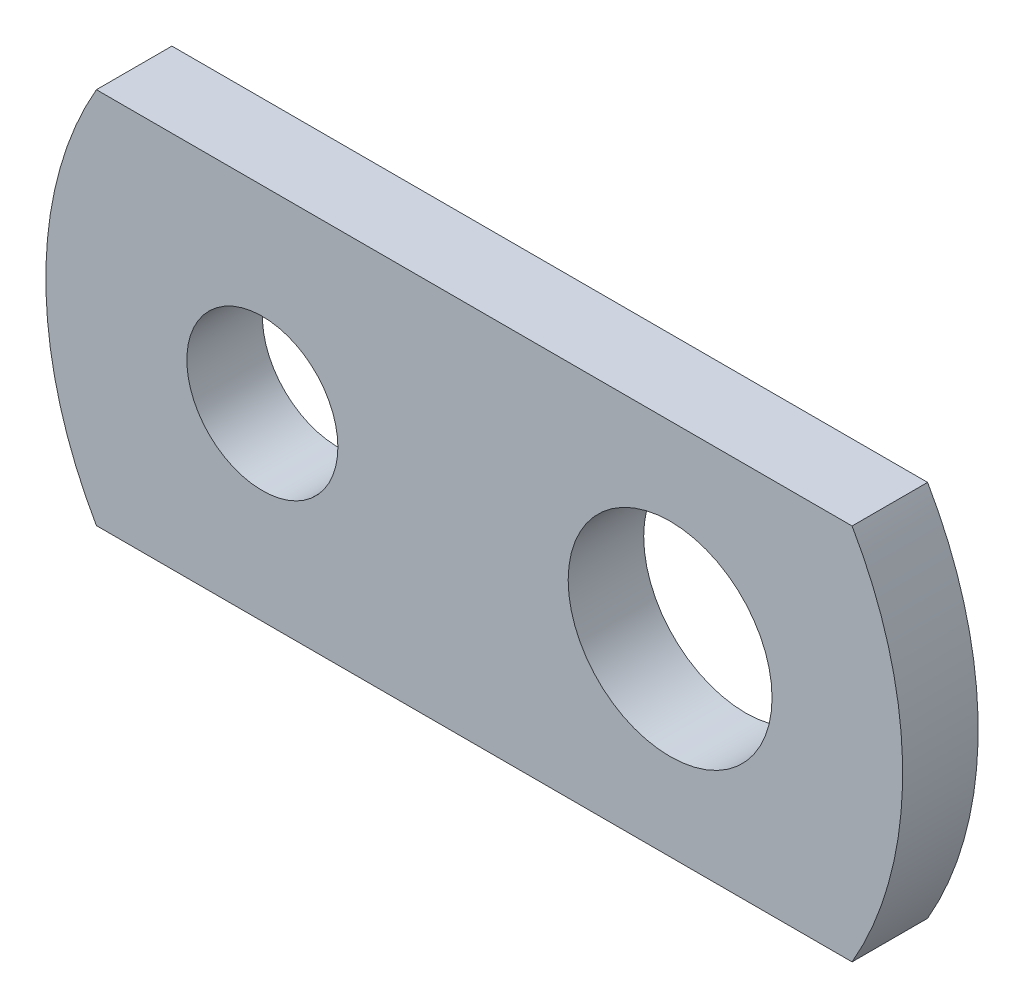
ISO-10303-21;
HEADER;
FILE_DESCRIPTION(('STEP AP214'),'2;1');
FILE_NAME('part.step','',(''),(''),'','','');
FILE_SCHEMA(('AUTOMOTIVE_DESIGN { 1 0 10303 214 1 1 1 1 }'));
ENDSEC;
DATA;
#1=APPLICATION_CONTEXT('core data for automotive mechanical design processes');
#2=APPLICATION_PROTOCOL_DEFINITION('international standard','automotive_design',2000,#1);
#3=PRODUCT_CONTEXT('',#1,'mechanical');
#4=PRODUCT('Part','Part','',(#3));
#5=PRODUCT_RELATED_PRODUCT_CATEGORY('part','',(#4));
#6=PRODUCT_DEFINITION_FORMATION('','',#4);
#7=PRODUCT_DEFINITION_CONTEXT('part definition',#1,'design');
#8=PRODUCT_DEFINITION('design','',#6,#7);
#9=PRODUCT_DEFINITION_SHAPE('','',#8);
#10=(LENGTH_UNIT() NAMED_UNIT(*) SI_UNIT(.MILLI.,.METRE.));
#11=(NAMED_UNIT(*) PLANE_ANGLE_UNIT() SI_UNIT($,.RADIAN.));
#12=(NAMED_UNIT(*) SI_UNIT($,.STERADIAN.) SOLID_ANGLE_UNIT());
#13=UNCERTAINTY_MEASURE_WITH_UNIT(LENGTH_MEASURE(1.E-05),#10,'distance_accuracy_value','');
#14=(GEOMETRIC_REPRESENTATION_CONTEXT(3) GLOBAL_UNCERTAINTY_ASSIGNED_CONTEXT((#13)) GLOBAL_UNIT_ASSIGNED_CONTEXT((#10,
#11,#12)) REPRESENTATION_CONTEXT('',''));
#15=CARTESIAN_POINT('',(0.,0.,0.));
#16=DIRECTION('',(0.,0.,1.));
#17=DIRECTION('',(1.,0.,0.));
#18=AXIS2_PLACEMENT_3D('',#15,#16,#17);
#19=CARTESIAN_POINT('',(63.4753090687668,-25.,10.));
#20=DIRECTION('',(0.,0.,1.));
#21=DIRECTION('',(1.,0.,0.));
#22=AXIS2_PLACEMENT_3D('',#19,#20,#21);
#23=PLANE('',#22);
#24=CARTESIAN_POINT('',(82.677228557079,-25.,10.));
#25=DIRECTION('',(0.,0.,1.));
#26=DIRECTION('',(1.,0.,0.));
#27=AXIS2_PLACEMENT_3D('',#24,#25,#26);
#28=CIRCLE('',#27,13.5);
#29=CARTESIAN_POINT('',(96.177228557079,-25.,10.));
#30=VERTEX_POINT('',#29);
#31=EDGE_CURVE('E90',#30,#30,#28,.T.);
#32=ORIENTED_EDGE('',*,*,#31,.F.);
#33=EDGE_LOOP('',(#32));
#34=FACE_BOUND('',#33,.T.);
#35=CARTESIAN_POINT('',(63.4753090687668,-25.,10.));
#36=DIRECTION('',(0.,0.,1.));
#37=DIRECTION('',(1.,0.,0.));
#38=AXIS2_PLACEMENT_3D('',#35,#36,#37);
#39=CIRCLE('',#38,50.);
#40=CARTESIAN_POINT('',(106.776579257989,-50.,10.));
#41=VERTEX_POINT('',#40);
#42=CARTESIAN_POINT('',(106.776579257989,0.,10.));
#43=VERTEX_POINT('',#42);
#44=EDGE_CURVE('E100',#41,#43,#39,.T.);
#45=ORIENTED_EDGE('',*,*,#44,.T.);
#46=DIRECTION('',(-1.,0.,0.));
#47=VECTOR('',#46,1.);
#48=CARTESIAN_POINT('',(6.69872981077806,0.,10.));
#49=LINE('',#48,#47);
#50=CARTESIAN_POINT('',(6.69872981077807,0.,10.));
#51=VERTEX_POINT('',#50);
#52=EDGE_CURVE('E85',#43,#51,#49,.T.);
#53=ORIENTED_EDGE('',*,*,#52,.T.);
#54=CARTESIAN_POINT('',(50.,-25.,10.));
#55=DIRECTION('',(0.,0.,1.));
#56=DIRECTION('',(1.,0.,0.));
#57=AXIS2_PLACEMENT_3D('',#54,#55,#56);
#58=CIRCLE('',#57,50.);
#59=CARTESIAN_POINT('',(6.69872981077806,-50.,10.));
#60=VERTEX_POINT('',#59);
#61=EDGE_CURVE('E51',#51,#60,#58,.T.);
#62=ORIENTED_EDGE('',*,*,#61,.T.);
#63=DIRECTION('',(1.,0.,0.));
#64=VECTOR('',#63,1.);
#65=CARTESIAN_POINT('',(6.69872981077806,-50.,10.));
#66=LINE('',#65,#64);
#67=EDGE_CURVE('E46',#60,#41,#66,.T.);
#68=ORIENTED_EDGE('',*,*,#67,.T.);
#69=EDGE_LOOP('',(#45,#53,#62,#68));
#70=FACE_BOUND('',#69,.T.);
#71=CARTESIAN_POINT('',(28.677228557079,-25.,10.));
#72=DIRECTION('',(0.,0.,1.));
#73=DIRECTION('',(1.,0.,0.));
#74=AXIS2_PLACEMENT_3D('',#71,#72,#73);
#75=CIRCLE('',#74,10.);
#76=CARTESIAN_POINT('',(38.677228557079,-25.,10.));
#77=VERTEX_POINT('',#76);
#78=EDGE_CURVE('E118',#77,#77,#75,.T.);
#79=ORIENTED_EDGE('',*,*,#78,.F.);
#80=EDGE_LOOP('',(#79));
#81=FACE_BOUND('',#80,.T.);
#82=ADVANCED_FACE('F31',(#34,#70,#81),#23,.T.);
#83=CARTESIAN_POINT('',(63.4753090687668,-25.,0.));
#84=DIRECTION('',(0.,0.,1.));
#85=DIRECTION('',(1.,0.,0.));
#86=AXIS2_PLACEMENT_3D('',#83,#84,#85);
#87=PLANE('',#86);
#88=CARTESIAN_POINT('',(82.677228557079,-25.,0.));
#89=DIRECTION('',(0.,0.,1.));
#90=DIRECTION('',(1.,0.,0.));
#91=AXIS2_PLACEMENT_3D('',#88,#89,#90);
#92=CIRCLE('',#91,13.5);
#93=CARTESIAN_POINT('',(96.177228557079,-25.,0.));
#94=VERTEX_POINT('',#93);
#95=EDGE_CURVE('E93',#94,#94,#92,.T.);
#96=ORIENTED_EDGE('',*,*,#95,.T.);
#97=EDGE_LOOP('',(#96));
#98=FACE_BOUND('',#97,.T.);
#99=CARTESIAN_POINT('',(63.4753090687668,-25.,0.));
#100=DIRECTION('',(0.,0.,1.));
#101=DIRECTION('',(1.,0.,0.));
#102=AXIS2_PLACEMENT_3D('',#99,#100,#101);
#103=CIRCLE('',#102,50.);
#104=CARTESIAN_POINT('',(106.776579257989,-50.,0.));
#105=VERTEX_POINT('',#104);
#106=CARTESIAN_POINT('',(106.776579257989,0.,0.));
#107=VERTEX_POINT('',#106);
#108=EDGE_CURVE('E77',#105,#107,#103,.T.);
#109=ORIENTED_EDGE('',*,*,#108,.F.);
#110=DIRECTION('',(1.,0.,0.));
#111=VECTOR('',#110,1.);
#112=CARTESIAN_POINT('',(6.69872981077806,-50.,0.));
#113=LINE('',#112,#111);
#114=CARTESIAN_POINT('',(6.69872981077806,-50.,0.));
#115=VERTEX_POINT('',#114);
#116=EDGE_CURVE('E98',#115,#105,#113,.T.);
#117=ORIENTED_EDGE('',*,*,#116,.F.);
#118=CARTESIAN_POINT('',(50.,-25.,0.));
#119=DIRECTION('',(0.,0.,1.));
#120=DIRECTION('',(1.,0.,0.));
#121=AXIS2_PLACEMENT_3D('',#118,#119,#120);
#122=CIRCLE('',#121,50.);
#123=CARTESIAN_POINT('',(6.69872981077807,0.,0.));
#124=VERTEX_POINT('',#123);
#125=EDGE_CURVE('E78',#124,#115,#122,.T.);
#126=ORIENTED_EDGE('',*,*,#125,.F.);
#127=DIRECTION('',(-1.,0.,0.));
#128=VECTOR('',#127,1.);
#129=CARTESIAN_POINT('',(6.69872981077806,0.,0.));
#130=LINE('',#129,#128);
#131=EDGE_CURVE('E72',#107,#124,#130,.T.);
#132=ORIENTED_EDGE('',*,*,#131,.F.);
#133=EDGE_LOOP('',(#109,#117,#126,#132));
#134=FACE_BOUND('',#133,.T.);
#135=CARTESIAN_POINT('',(28.677228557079,-25.,0.));
#136=DIRECTION('',(0.,0.,1.));
#137=DIRECTION('',(1.,0.,0.));
#138=AXIS2_PLACEMENT_3D('',#135,#136,#137);
#139=CIRCLE('',#138,10.);
#140=CARTESIAN_POINT('',(38.677228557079,-25.,0.));
#141=VERTEX_POINT('',#140);
#142=EDGE_CURVE('E120',#141,#141,#139,.T.);
#143=ORIENTED_EDGE('',*,*,#142,.T.);
#144=EDGE_LOOP('',(#143));
#145=FACE_BOUND('',#144,.T.);
#146=ADVANCED_FACE('F73',(#98,#134,#145),#87,.F.);
#147=CARTESIAN_POINT('',(63.4753090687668,-25.,10.));
#148=DIRECTION('',(0.,0.,-1.));
#149=DIRECTION('',(-1.,0.,0.));
#150=AXIS2_PLACEMENT_3D('',#147,#148,#149);
#151=CYLINDRICAL_SURFACE('',#150,50.);
#152=ORIENTED_EDGE('',*,*,#108,.T.);
#153=DIRECTION('',(0.,0.,-1.));
#154=VECTOR('',#153,1.);
#155=CARTESIAN_POINT('',(106.776579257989,0.,10.));
#156=LINE('',#155,#154);
#157=EDGE_CURVE('E11',#43,#107,#156,.T.);
#158=ORIENTED_EDGE('',*,*,#157,.F.);
#159=ORIENTED_EDGE('',*,*,#44,.F.);
#160=DIRECTION('',(0.,0.,-1.));
#161=VECTOR('',#160,1.);
#162=CARTESIAN_POINT('',(106.776579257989,-50.,10.));
#163=LINE('',#162,#161);
#164=EDGE_CURVE('E89',#41,#105,#163,.T.);
#165=ORIENTED_EDGE('',*,*,#164,.T.);
#166=EDGE_LOOP('',(#152,#158,#159,#165));
#167=FACE_BOUND('',#166,.T.);
#168=ADVANCED_FACE('F33',(#167),#151,.T.);
#169=CARTESIAN_POINT('',(6.69872981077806,0.,10.));
#170=DIRECTION('',(0.,-1.,0.));
#171=DIRECTION('',(0.,0.,-1.));
#172=AXIS2_PLACEMENT_3D('',#169,#170,#171);
#173=PLANE('',#172);
#174=ORIENTED_EDGE('',*,*,#131,.T.);
#175=DIRECTION('',(0.,0.,-1.));
#176=VECTOR('',#175,1.);
#177=CARTESIAN_POINT('',(6.69872981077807,0.,10.));
#178=LINE('',#177,#176);
#179=EDGE_CURVE('E39',#51,#124,#178,.T.);
#180=ORIENTED_EDGE('',*,*,#179,.F.);
#181=ORIENTED_EDGE('',*,*,#52,.F.);
#182=ORIENTED_EDGE('',*,*,#157,.T.);
#183=EDGE_LOOP('',(#174,#180,#181,#182));
#184=FACE_BOUND('',#183,.T.);
#185=ADVANCED_FACE('F84',(#184),#173,.F.);
#186=CARTESIAN_POINT('',(50.,-25.,10.));
#187=DIRECTION('',(0.,0.,-1.));
#188=DIRECTION('',(-1.,0.,0.));
#189=AXIS2_PLACEMENT_3D('',#186,#187,#188);
#190=CYLINDRICAL_SURFACE('',#189,50.);
#191=ORIENTED_EDGE('',*,*,#125,.T.);
#192=DIRECTION('',(0.,0.,-1.));
#193=VECTOR('',#192,1.);
#194=CARTESIAN_POINT('',(6.69872981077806,-50.,10.));
#195=LINE('',#194,#193);
#196=EDGE_CURVE('E106',#60,#115,#195,.T.);
#197=ORIENTED_EDGE('',*,*,#196,.F.);
#198=ORIENTED_EDGE('',*,*,#61,.F.);
#199=ORIENTED_EDGE('',*,*,#179,.T.);
#200=EDGE_LOOP('',(#191,#197,#198,#199));
#201=FACE_BOUND('',#200,.T.);
#202=ADVANCED_FACE('F109',(#201),#190,.T.);
#203=CARTESIAN_POINT('',(6.69872981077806,-50.,10.));
#204=DIRECTION('',(0.,1.,0.));
#205=DIRECTION('',(0.,0.,1.));
#206=AXIS2_PLACEMENT_3D('',#203,#204,#205);
#207=PLANE('',#206);
#208=ORIENTED_EDGE('',*,*,#116,.T.);
#209=ORIENTED_EDGE('',*,*,#164,.F.);
#210=ORIENTED_EDGE('',*,*,#67,.F.);
#211=ORIENTED_EDGE('',*,*,#196,.T.);
#212=EDGE_LOOP('',(#208,#209,#210,#211));
#213=FACE_BOUND('',#212,.T.);
#214=ADVANCED_FACE('F111',(#213),#207,.F.);
#215=CARTESIAN_POINT('',(82.677228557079,-25.,10.));
#216=DIRECTION('',(0.,0.,-1.));
#217=DIRECTION('',(-1.,0.,0.));
#218=AXIS2_PLACEMENT_3D('',#215,#216,#217);
#219=CYLINDRICAL_SURFACE('',#218,13.5);
#220=ORIENTED_EDGE('',*,*,#31,.T.);
#221=EDGE_LOOP('',(#220));
#222=FACE_BOUND('',#221,.T.);
#223=ORIENTED_EDGE('',*,*,#95,.F.);
#224=EDGE_LOOP('',(#223));
#225=FACE_BOUND('',#224,.T.);
#226=ADVANCED_FACE('F129',(#222,#225),#219,.F.);
#227=CARTESIAN_POINT('',(28.677228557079,-25.,10.));
#228=DIRECTION('',(0.,0.,-1.));
#229=DIRECTION('',(-1.,0.,0.));
#230=AXIS2_PLACEMENT_3D('',#227,#228,#229);
#231=CYLINDRICAL_SURFACE('',#230,10.);
#232=ORIENTED_EDGE('',*,*,#78,.T.);
#233=EDGE_LOOP('',(#232));
#234=FACE_BOUND('',#233,.T.);
#235=ORIENTED_EDGE('',*,*,#142,.F.);
#236=EDGE_LOOP('',(#235));
#237=FACE_BOUND('',#236,.T.);
#238=ADVANCED_FACE('F127',(#234,#237),#231,.F.);
#239=CLOSED_SHELL('',(#82,#146,#168,#185,#202,#214,#226,#238));
#240=MANIFOLD_SOLID_BREP('B2',#239);
#241=ADVANCED_BREP_SHAPE_REPRESENTATION('',(#18,#240),#14);
#242=SHAPE_DEFINITION_REPRESENTATION(#9,#241);
ENDSEC;
END-ISO-10303-21;
